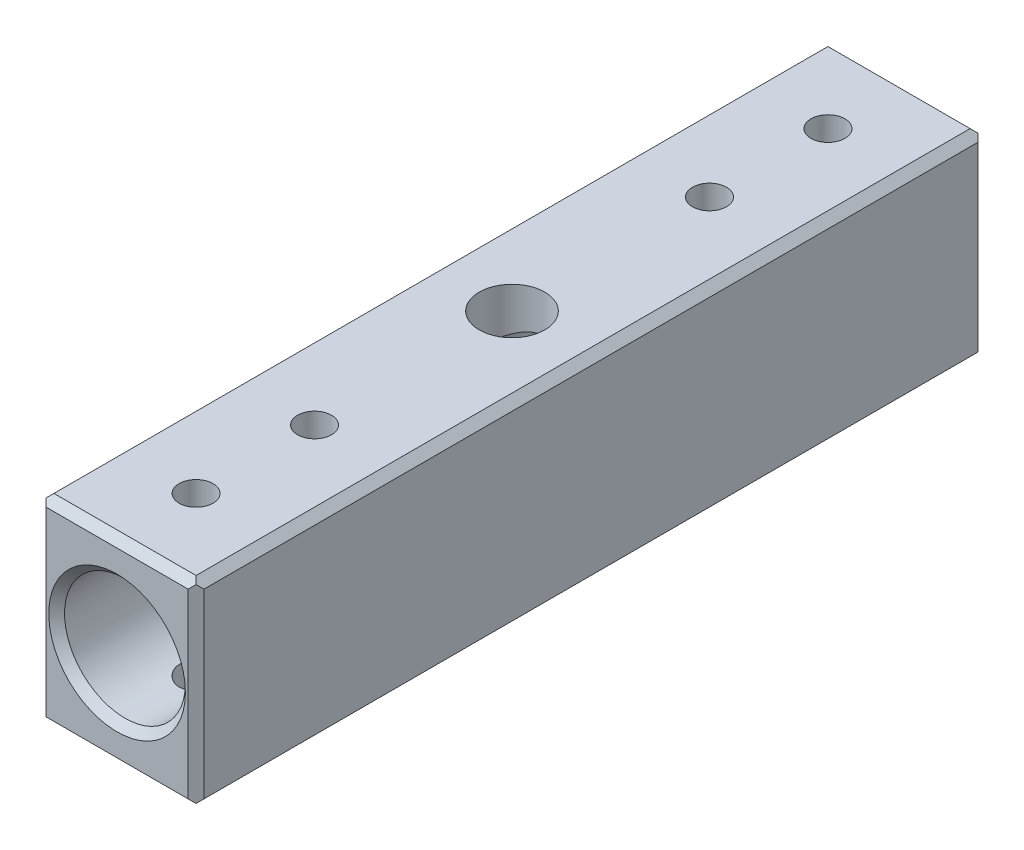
from build123d import *

# Parameters (mm, degrees)
SKETCH_2_W          = 20
SKETCH_2_H          = 25
SKETCH_2_R          = 7.65
EXTRUDE_1_DEPTH     = 100
SKETCH_3_R          = 2.15
SKETCH_3_R_2        = 4.15
CUT_EXTRUDE_2_DEPTH = 104.561575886
CHAMFER_1_SIZE      = 1
CHAMFER_2_SIZE      = 1


with BuildPart() as part:
    # Sketch 2 → Extrude 1 (new body)
    with BuildSketch(Plane.XY):
        Rectangle(SKETCH_2_W, SKETCH_2_H)
        Circle(SKETCH_2_R, mode=Mode.SUBTRACT)
    extrude(amount=-EXTRUDE_1_DEPTH)

    # Sketch 3 → Cut-Extrude 2 (cut, through all)
    with BuildSketch(Plane(origin=(0, 12.5, 0), x_dir=(1, 0, 0), z_dir=(0, 1, 0))):
        with Locations(Location((0, 75, 0), (0, 0, 270))):
            Circle(SKETCH_3_R)
        with Locations(Location((0, 50, 0), (0, 0, 270))):
            Circle(SKETCH_3_R_2)
        with Locations(Location((0, 90, 0), (0, 0, 270))):
            Circle(SKETCH_3_R)
        with Locations(Location((0, 10, 0), (0, 0, 270))):
            Circle(SKETCH_3_R)
        with Locations(Location((0, 25, 0), (0, 0, 270))):
            Circle(SKETCH_3_R)
    extrude(amount=-CUT_EXTRUDE_2_DEPTH, mode=Mode.SUBTRACT)

    # Chamfer 1
    chamfer_1_edges = [part.edges().sort_by_distance(p)[0] for p in [
        (-7.65, 0, -100),
        (-7.65, 0, 0),
        (-10, 0, -100),
        (0, -12.5, -100),
        (10, 0, -100),
        (0, -12.5, 0),
        (-10, 0, 0),
        (0, 12.5, 0),
        (10, 0, 0),
        (0, 12.5, -100),
    ]]
    chamfer(chamfer_1_edges, length=CHAMFER_1_SIZE)

    # Chamfer 2
    chamfer_2_edges = [part.edges().sort_by_distance(p)[0] for p in [
        (10, 12.5, -50),
        (-10, 12.5, -50),
        (-10, -12.5, -50),
        (10, -12.5, -50),
    ]]
    chamfer(chamfer_2_edges, length=CHAMFER_2_SIZE)


solid = part.part
